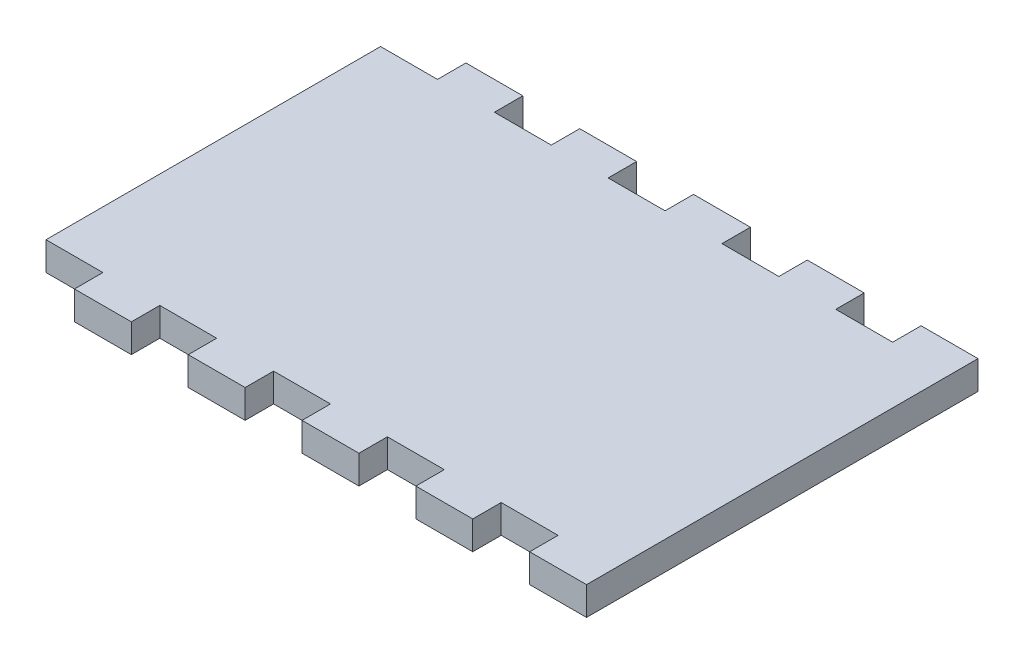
from build123d import *

# Parameters (mm, degrees)
SKETCH1_W           = 63.5
SKETCH1_H           = 43.688
BODY_DEPTH          = 3.175
SKETCH4_W           = 6.35
SKETCH4_H           = 3.175
TEETH_DEPTH         = 3.175
TEETH_PATTERN_COUNT = 5
TEETH_PATTERN_PITCH = 12.7


with BuildPart() as part:
    # Sketch1 → body (new body)
    with BuildSketch(Plane(origin=(0, 0, 0), x_dir=(1, 0, 0), z_dir=(0, 1, 0))):
        with Locations((31.75, 21.844)):
            Rectangle(SKETCH1_W, SKETCH1_H)
    extrude(amount=BODY_DEPTH)

    # Sketch4 → teeth (cut)
    with BuildSketch(Plane(origin=(0, 3.175, 0), x_dir=(1, 0, 0), z_dir=(0, 1, 0))):
        with Locations((3.175, 42.1005)):
            Rectangle(SKETCH4_W, SKETCH4_H)
        with Locations((3.175, 1.5875)):
            Rectangle(SKETCH4_W, SKETCH4_H)
    teeth = extrude(amount=-TEETH_DEPTH, mode=Mode.SUBTRACT)

    # teeth pattern: teeth ×5
    with Locations(*[(i * TEETH_PATTERN_PITCH, 0, 0) for i in range(1, TEETH_PATTERN_COUNT)]):
        add(teeth, mode=Mode.SUBTRACT)


solid = part.part
